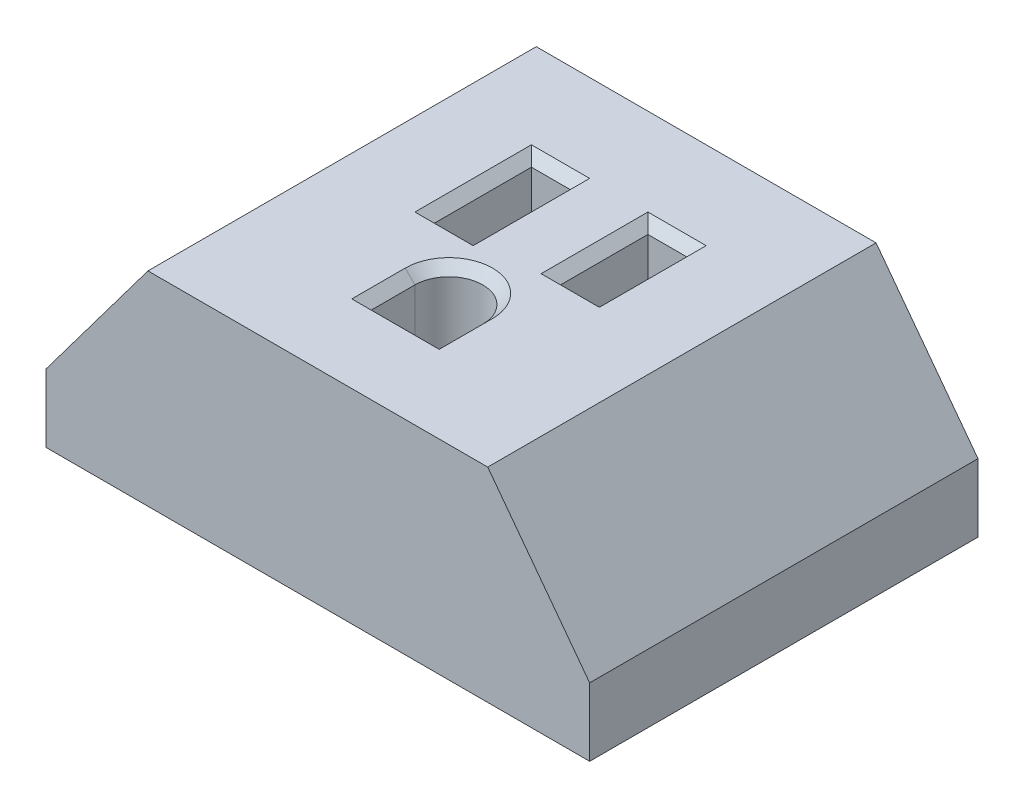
from build123d import *

# Parameters (mm, degrees)
BASE_EXTRUDE_DEPTH = 40
CUT_EXTRUDE1_REACH = 55.151
SKETCH2_W          = 4
SKETCH2_H          = 10
SKETCH2_H_2        = 9
CHAMFER1_SIZE      = 1


with BuildPart() as part:
    # Sketch3 → Base-Extrude (new body)
    with BuildSketch(Plane.XY):
        Polygon((28, 7), (17.5, 21), (-17.5, 21), (-28, 7), (-28, 0), (28, 0), align=None)
    extrude(amount=-BASE_EXTRUDE_DEPTH)

    # Sketch2 → Cut-Extrude1 (cut, up to next)
    with BuildSketch(Plane(origin=(0, 21, 0), x_dir=(1, 0, 0), z_dir=(0, 1, 0)), mode=Mode.PRIVATE) as cut_extrude1_sk1:
        with Locations((-6, 25)):
            Rectangle(SKETCH2_W, SKETCH2_H)
    cut_extrude1_tool1 = extrude(cut_extrude1_sk1.sketch, amount=-CUT_EXTRUDE1_REACH, mode=Mode.PRIVATE) & part.part
    # Sketch2 → Cut-Extrude1 (cut, up to next)
    with BuildSketch(Plane(origin=(0, 21, 0), x_dir=(1, 0, 0), z_dir=(0, 1, 0)), mode=Mode.PRIVATE) as cut_extrude1_sk2:
        with Locations((6, 25.5)):
            Rectangle(SKETCH2_W, SKETCH2_H_2)
    cut_extrude1_tool2 = extrude(cut_extrude1_sk2.sketch, amount=-CUT_EXTRUDE1_REACH, mode=Mode.PRIVATE) & part.part
    # Sketch2 → Cut-Extrude1 (cut, up to next)
    with BuildSketch(Plane(origin=(0, 21, 0), x_dir=(1, 0, 0), z_dir=(0, 1, 0)), mode=Mode.PRIVATE) as cut_extrude1_sk3:
        with BuildLine():
            Line((-3.5, 9), (3.5, 9))
            Line((3.5, 9), (3.5, 13.5))
            ThreePointArc((3.5, 13.5), (0, 17), (-3.5, 13.5))
            Line((-3.5, 13.5), (-3.5, 9))
        make_face()
    cut_extrude1_tool3 = extrude(cut_extrude1_sk3.sketch, amount=-CUT_EXTRUDE1_REACH, mode=Mode.PRIVATE) & part.part
    add(cut_extrude1_tool1.solids().sort_by_distance((-6, 21, -25))[0], mode=Mode.SUBTRACT)
    add(cut_extrude1_tool2.solids().sort_by_distance((6, 21, -25.5))[0], mode=Mode.SUBTRACT)
    add(cut_extrude1_tool3.solids().sort_by_distance((0, 21, -12.666539))[0], mode=Mode.SUBTRACT)

    # Chamfer1
    chamfer1_edges = [part.edges().sort_by_distance(p)[0] for p in [
        (-8, 21, -25),
        (-6, 21, -20),
        (-4, 21, -25),
        (-6, 21, -30),
        (4, 21, -25.5),
        (6, 21, -21),
        (8, 21, -25.5),
        (6, 21, -30),
        (3.5, 21, -11.25),
        (0, 21, -17),
        (-3.5, 21, -11.25),
        (0, 21, -9),
    ]]
    chamfer(chamfer1_edges, length=CHAMFER1_SIZE)


solid = part.part
